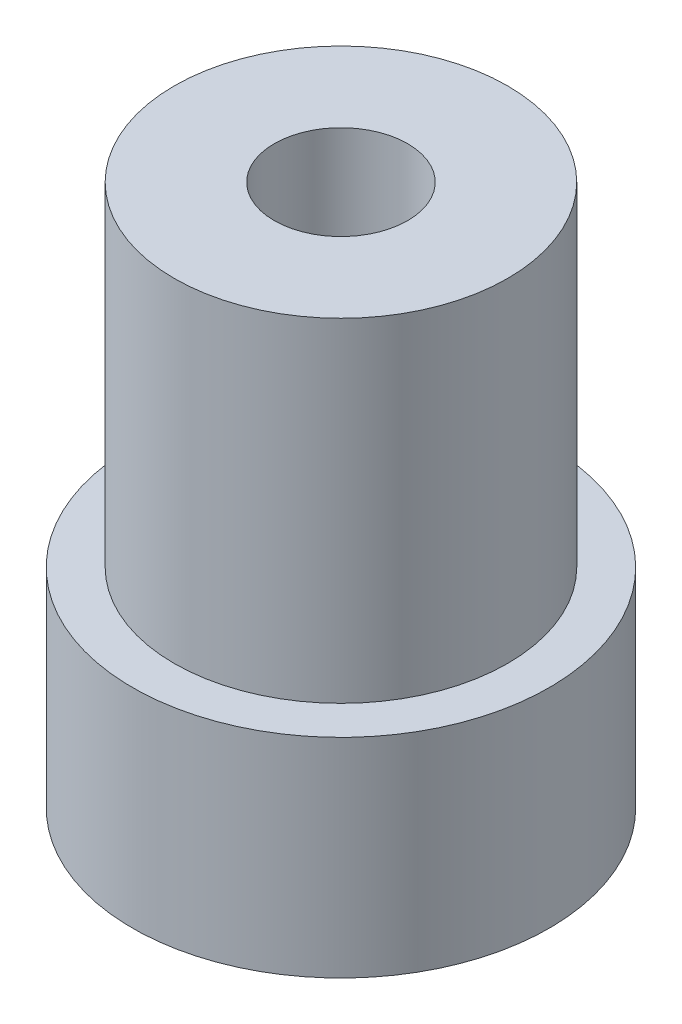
from build123d import *
from build123d.topology import SkipClean

# Parameters (mm, degrees)
SKETCH_1_R      = 4
SKETCH_1_R_2    = 1.6
EXTRUDE_1_DEPTH = 8
SKETCH_2_R      = 5
EXTRUDE_2_DEPTH = 5
EXTRUDE_START   = 2
SKETCH_3_R      = 1.6
EXTRUDE_3_DEPTH = 2


with BuildPart() as part:
    # Sketch 1 → Extrude 1 (new body)
    with BuildSketch(Plane(origin=(0, 0, 0), x_dir=(1, 0, 0), z_dir=(0, 1, 0))):
        with Locations(Location((0, 0, 0), (0, 0, 270))):
            Circle(SKETCH_1_R)
        with Locations(Location((0, 0, 0), (0, 0, 270))):
            Circle(SKETCH_1_R_2, mode=Mode.SUBTRACT)
    extrude(amount=EXTRUDE_1_DEPTH)



with BuildPart() as body_2:
    # Sketch 2 → Extrude 2 (new body)
    with BuildSketch(Plane.XZ):
        with Locations(Location((0, 0, 0), (0, 0, 270))):
            Circle(SKETCH_2_R)
        Polygon((3.319764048, 0), (1.659882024, 2.875), (-1.659882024, 2.875), (-3.319764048, 0), (-1.659882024, -2.875), (1.659882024, -2.875), align=None, mode=Mode.SUBTRACT)
    extrude(amount=EXTRUDE_2_DEPTH)


with BuildPart() as part_1:
    with SkipClean():  # the faces are left unmerged after this step: merging them gives an invalid solid
        add(part.part)

        add(body_2.part)  # Extrude 3 merges body 2
        # Sketch 3 → Extrude 3 (add)
        with BuildSketch(Plane.XZ.offset(EXTRUDE_START)):
            Polygon((3.319764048, 0), (1.659882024, 2.875), (-1.659882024, 2.875), (-3.319764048, 0), (-1.659882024, -2.875), (1.659882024, -2.875), align=None)
            with Locations(Location((0, 0, 0), (0, 0, 270))):
                Circle(SKETCH_3_R, mode=Mode.SUBTRACT)
        extrude(amount=-EXTRUDE_3_DEPTH)


solid = part_1.part
